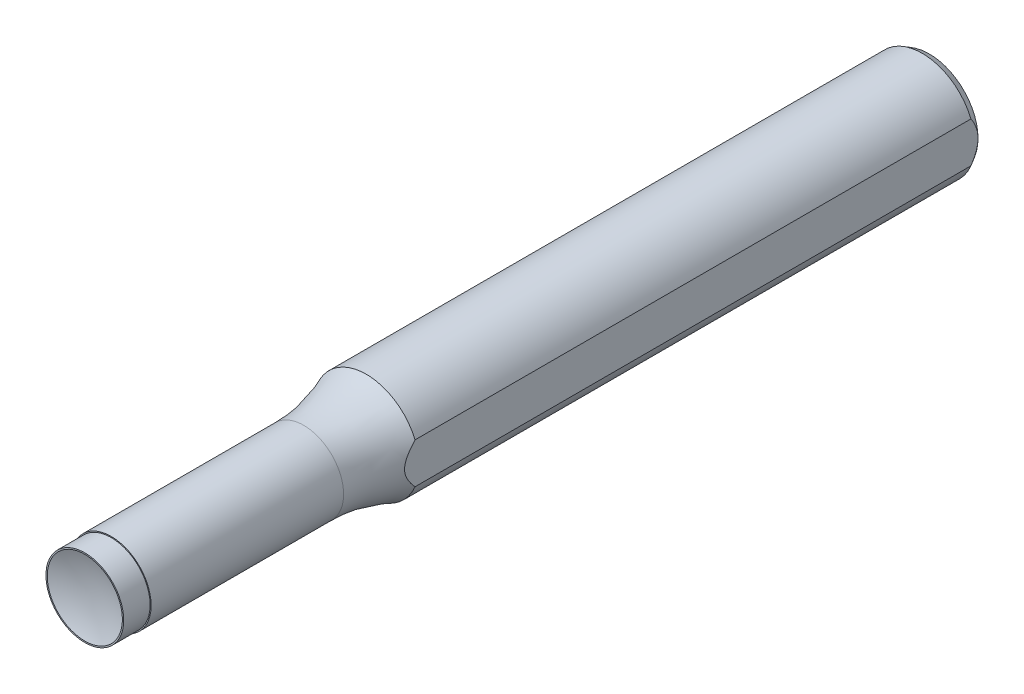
from build123d import *

# Parameters (mm, degrees)
SKETCH1_R           = 7.94
BOSS_EXTRUDE1_DEPTH = 127
SKETCH2_OUTSIDE_W   = 43.674
SKETCH2_OUTSIDE_H   = 43.674
SKETCH2_OUTSIDE_R   = 6
CUT_EXTRUDE1_DEPTH  = 42.333333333
SKETCH3_OUTSIDE_W   = 43.674
SKETCH3_OUTSIDE_H   = 43.674
SKETCH3_OUTSIDE_R   = 5.85
CUT_EXTRUDE2_DEPTH  = 3.97
CHAMFER1_SIZE       = 1.058666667
CHAMFER1_SIZE2      = 0.611221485
SKETCH7_W           = 6.109862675
SKETCH7_H           = 6.109862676
CUT_EXTRUDE3_DEPTH  = 128.495439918


with BuildPart() as part:
    # Sketch1 → Boss-Extrude1 (new body)
    with BuildSketch(Plane.XY):
        Circle(SKETCH1_R)
    extrude(amount=-BOSS_EXTRUDE1_DEPTH)

    # Sketch2 outside → Cut-Extrude1 (cut)
    with BuildSketch(Plane.XY):
        Rectangle(SKETCH2_OUTSIDE_W, SKETCH2_OUTSIDE_H)
        Circle(SKETCH2_OUTSIDE_R, mode=Mode.SUBTRACT)
    extrude(amount=-CUT_EXTRUDE1_DEPTH, mode=Mode.SUBTRACT)

    # Sketch3 outside → Cut-Extrude2 (cut)
    with BuildSketch(Plane.XY):
        Rectangle(SKETCH3_OUTSIDE_W, SKETCH3_OUTSIDE_H)
        Circle(SKETCH3_OUTSIDE_R, mode=Mode.SUBTRACT)
    extrude(amount=-CUT_EXTRUDE2_DEPTH, mode=Mode.SUBTRACT)

    # Sketch4 → Cut-Revolve1 (revolve, cut)
    with BuildSketch(Plane(origin=(0, 0, 0), x_dir=(0, 0, -1), z_dir=(1, 0, 0)), mode=Mode.PRIVATE) as cut_revolve1_sk:
        with BuildLine():
            Line((0, 0), (0, 5.65))
            ThreePointArc((0, 5.65), (0.777175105, 2.872379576), (1.039113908, 0))
            Line((1.039113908, 0), (0, 0))
        make_face()
    revolve(cut_revolve1_sk.sketch.rotate(Axis((0, 0, 0), (0, 0, -1)), 180), axis=Axis((0, 0, 0), (0, 0, -1)), mode=Mode.SUBTRACT)

    # Chamfer1
    chamfer1_edges = [part.edges().sort_by_distance(p)[0] for p in [
        (-7.94, 0, -127),
    ]]
    chamfer1_side = [part.faces().sort_by_distance(p)[0] for p in [
        (-7.94, 0, -84.666666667),
    ]]
    chamfer(chamfer1_edges, length=CHAMFER1_SIZE, length2=CHAMFER1_SIZE2, reference=chamfer1_side[0])

    # Sketch5 → Revolve1 (revolve)
    with BuildSketch(Plane(origin=(0, 0, 0), x_dir=(0, 0, -1), z_dir=(1, 0, 0)), mode=Mode.PRIVATE) as revolve1_sk:
        with BuildLine():
            Line((42.333333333, 0), (32.917495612, 0))
            Line((32.917495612, 0), (32.917495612, 6))
            ThreePointArc((32.917495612, 6), (37.724303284, 6.49004072), (42.333333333, 7.94))
            Line((42.333333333, 7.94), (42.333333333, 0))
        make_face()
    revolve(revolve1_sk.sketch.rotate(Axis((0, 0, -42.333333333), (0, 0, 1)), 270), axis=Axis((0, 0, -42.333333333), (0, 0, 1)))

    # Sketch7 → Cut-Extrude3 (cut, through all)
    with BuildSketch(Plane(origin=(0, 0, -127), x_dir=(-1, 0, 0), z_dir=(0, 0, -1))):
        with Locations((-10.383709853, 0)):
            Rectangle(SKETCH7_W, SKETCH7_H)
    extrude(amount=-CUT_EXTRUDE3_DEPTH, mode=Mode.SUBTRACT)


solid = part.part
